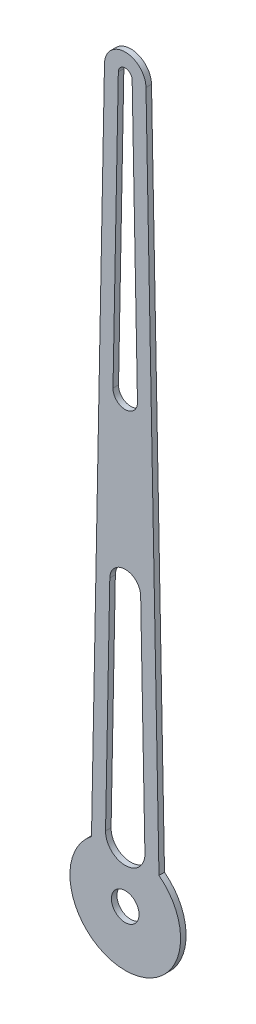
ISO-10303-21;
HEADER;
FILE_DESCRIPTION(('STEP AP214'),'2;1');
FILE_NAME('part.step','',(''),(''),'','','');
FILE_SCHEMA(('AUTOMOTIVE_DESIGN { 1 0 10303 214 1 1 1 1 }'));
ENDSEC;
DATA;
#1=APPLICATION_CONTEXT('core data for automotive mechanical design processes');
#2=APPLICATION_PROTOCOL_DEFINITION('international standard','automotive_design',2000,#1);
#3=PRODUCT_CONTEXT('',#1,'mechanical');
#4=PRODUCT('Part','Part','',(#3));
#5=PRODUCT_RELATED_PRODUCT_CATEGORY('part','',(#4));
#6=PRODUCT_DEFINITION_FORMATION('','',#4);
#7=PRODUCT_DEFINITION_CONTEXT('part definition',#1,'design');
#8=PRODUCT_DEFINITION('design','',#6,#7);
#9=PRODUCT_DEFINITION_SHAPE('','',#8);
#10=(LENGTH_UNIT() NAMED_UNIT(*) SI_UNIT(.MILLI.,.METRE.));
#11=(NAMED_UNIT(*) PLANE_ANGLE_UNIT() SI_UNIT($,.RADIAN.));
#12=(NAMED_UNIT(*) SI_UNIT($,.STERADIAN.) SOLID_ANGLE_UNIT());
#13=UNCERTAINTY_MEASURE_WITH_UNIT(LENGTH_MEASURE(1.E-05),#10,'distance_accuracy_value','');
#14=(GEOMETRIC_REPRESENTATION_CONTEXT(3) GLOBAL_UNCERTAINTY_ASSIGNED_CONTEXT((#13)) GLOBAL_UNIT_ASSIGNED_CONTEXT((#10,
#11,#12)) REPRESENTATION_CONTEXT('',''));
#15=CARTESIAN_POINT('',(0.,0.,0.));
#16=DIRECTION('',(0.,0.,1.));
#17=DIRECTION('',(1.,0.,0.));
#18=AXIS2_PLACEMENT_3D('',#15,#16,#17);
#19=CARTESIAN_POINT('',(0.,0.,0.1));
#20=DIRECTION('',(0.,0.,1.));
#21=DIRECTION('',(1.,0.,0.));
#22=AXIS2_PLACEMENT_3D('',#19,#20,#21);
#23=PLANE('',#22);
#24=CARTESIAN_POINT('',(0.,0.,0.1));
#25=DIRECTION('',(0.,0.,1.));
#26=DIRECTION('',(1.,0.,0.));
#27=AXIS2_PLACEMENT_3D('',#24,#25,#26);
#28=CIRCLE('',#27,0.25);
#29=CARTESIAN_POINT('',(0.25,0.,0.1));
#30=VERTEX_POINT('',#29);
#31=EDGE_CURVE('E167',#30,#30,#28,.T.);
#32=ORIENTED_EDGE('',*,*,#31,.F.);
#33=EDGE_LOOP('',(#32));
#34=FACE_BOUND('',#33,.T.);
#35=CARTESIAN_POINT('',(0.,0.,0.1));
#36=DIRECTION('',(0.,0.,1.));
#37=DIRECTION('',(1.,0.,0.));
#38=AXIS2_PLACEMENT_3D('',#35,#36,#37);
#39=CIRCLE('',#38,1.);
#40=CARTESIAN_POINT('',(-0.609872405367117,0.792499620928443,0.1));
#41=VERTEX_POINT('',#40);
#42=CARTESIAN_POINT('',(0.609872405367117,0.792499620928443,0.1));
#43=VERTEX_POINT('',#42);
#44=EDGE_CURVE('E201',#41,#43,#39,.T.);
#45=ORIENTED_EDGE('',*,*,#44,.T.);
#46=DIRECTION('',(-0.0192307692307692,0.999815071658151,0.));
#47=VECTOR('',#46,1.);
#48=CARTESIAN_POINT('',(0.374930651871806,13.0072115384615,0.1));
#49=LINE('',#48,#47);
#50=CARTESIAN_POINT('',(0.374930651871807,13.0072115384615,0.1));
#51=VERTEX_POINT('',#50);
#52=EDGE_CURVE('E206',#43,#51,#49,.T.);
#53=ORIENTED_EDGE('',*,*,#52,.T.);
#54=CARTESIAN_POINT('',(0.,13.,0.1));
#55=DIRECTION('',(0.,0.,1.));
#56=DIRECTION('',(1.,0.,0.));
#57=AXIS2_PLACEMENT_3D('',#54,#55,#56);
#58=CIRCLE('',#57,0.375);
#59=CARTESIAN_POINT('',(-0.374930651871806,13.0072115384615,0.1));
#60=VERTEX_POINT('',#59);
#61=EDGE_CURVE('E207',#51,#60,#58,.T.);
#62=ORIENTED_EDGE('',*,*,#61,.T.);
#63=DIRECTION('',(-0.0192307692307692,-0.999815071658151,0.));
#64=VECTOR('',#63,1.);
#65=CARTESIAN_POINT('',(-0.374930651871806,13.0072115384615,0.1));
#66=LINE('',#65,#64);
#67=EDGE_CURVE('E211',#60,#41,#66,.T.);
#68=ORIENTED_EDGE('',*,*,#67,.T.);
#69=EDGE_LOOP('',(#45,#53,#62,#68));
#70=FACE_BOUND('',#69,.T.);
#71=DIRECTION('',(-0.0192307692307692,-0.999815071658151,0.));
#72=VECTOR('',#71,1.);
#73=CARTESIAN_POINT('',(-0.124976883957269,13.0024038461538,0.1));
#74=LINE('',#73,#72);
#75=CARTESIAN_POINT('',(-0.124976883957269,13.0024038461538,0.1));
#76=VERTEX_POINT('',#75);
#77=CARTESIAN_POINT('',(-0.221112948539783,8.00425295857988,0.1));
#78=VERTEX_POINT('',#77);
#79=EDGE_CURVE('E173',#76,#78,#74,.T.);
#80=ORIENTED_EDGE('',*,*,#79,.F.);
#81=CARTESIAN_POINT('',(0.,13.,0.1));
#82=DIRECTION('',(0.,0.,1.));
#83=DIRECTION('',(1.,0.,0.));
#84=AXIS2_PLACEMENT_3D('',#81,#82,#83);
#85=CIRCLE('',#84,0.125);
#86=CARTESIAN_POINT('',(0.124976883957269,13.0024038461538,0.1));
#87=VERTEX_POINT('',#86);
#88=EDGE_CURVE('E171',#87,#76,#85,.T.);
#89=ORIENTED_EDGE('',*,*,#88,.F.);
#90=DIRECTION('',(-0.0192307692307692,0.999815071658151,0.));
#91=VECTOR('',#90,1.);
#92=CARTESIAN_POINT('',(0.124976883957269,13.0024038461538,0.1));
#93=LINE('',#92,#91);
#94=CARTESIAN_POINT('',(0.221112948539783,8.00425295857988,0.1));
#95=VERTEX_POINT('',#94);
#96=EDGE_CURVE('E177',#95,#87,#93,.T.);
#97=ORIENTED_EDGE('',*,*,#96,.F.);
#98=CARTESIAN_POINT('',(0.,8.,0.1));
#99=DIRECTION('',(0.,0.,1.));
#100=DIRECTION('',(1.,0.,0.));
#101=AXIS2_PLACEMENT_3D('',#98,#99,#100);
#102=CIRCLE('',#101,0.221153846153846);
#103=EDGE_CURVE('E176',#78,#95,#102,.T.);
#104=ORIENTED_EDGE('',*,*,#103,.F.);
#105=EDGE_LOOP('',(#80,#89,#97,#104));
#106=FACE_BOUND('',#105,.T.);
#107=DIRECTION('',(-0.0192307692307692,-0.999815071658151,0.));
#108=VECTOR('',#107,1.);
#109=CARTESIAN_POINT('',(-0.278794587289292,5.0053624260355,0.1));
#110=LINE('',#109,#108);
#111=CARTESIAN_POINT('',(-0.278794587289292,5.0053624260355,0.1));
#112=VERTEX_POINT('',#111);
#113=CARTESIAN_POINT('',(-0.355703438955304,1.00684171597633,0.1));
#114=VERTEX_POINT('',#113);
#115=EDGE_CURVE('E140',#112,#114,#110,.T.);
#116=ORIENTED_EDGE('',*,*,#115,.F.);
#117=CARTESIAN_POINT('',(0.,5.,0.1));
#118=DIRECTION('',(0.,0.,1.));
#119=DIRECTION('',(1.,0.,0.));
#120=AXIS2_PLACEMENT_3D('',#117,#118,#119);
#121=CIRCLE('',#120,0.278846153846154);
#122=CARTESIAN_POINT('',(0.278794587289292,5.0053624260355,0.1));
#123=VERTEX_POINT('',#122);
#124=EDGE_CURVE('E128',#123,#112,#121,.T.);
#125=ORIENTED_EDGE('',*,*,#124,.F.);
#126=DIRECTION('',(-0.0192307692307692,0.999815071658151,0.));
#127=VECTOR('',#126,1.);
#128=CARTESIAN_POINT('',(0.278794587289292,5.0053624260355,0.1));
#129=LINE('',#128,#127);
#130=CARTESIAN_POINT('',(0.355703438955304,1.00684171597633,0.1));
#131=VERTEX_POINT('',#130);
#132=EDGE_CURVE('E155',#131,#123,#129,.T.);
#133=ORIENTED_EDGE('',*,*,#132,.F.);
#134=CARTESIAN_POINT('',(0.,1.,0.1));
#135=DIRECTION('',(0.,0.,1.));
#136=DIRECTION('',(1.,0.,0.));
#137=AXIS2_PLACEMENT_3D('',#134,#135,#136);
#138=CIRCLE('',#137,0.355769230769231);
#139=EDGE_CURVE('E147',#114,#131,#138,.T.);
#140=ORIENTED_EDGE('',*,*,#139,.F.);
#141=EDGE_LOOP('',(#116,#125,#133,#140));
#142=FACE_BOUND('',#141,.T.);
#143=ADVANCED_FACE('F41',(#34,#70,#106,#142),#23,.T.);
#144=CARTESIAN_POINT('',(0.,0.,0.));
#145=DIRECTION('',(0.,0.,1.));
#146=DIRECTION('',(1.,0.,0.));
#147=AXIS2_PLACEMENT_3D('',#144,#145,#146);
#148=PLANE('',#147);
#149=CARTESIAN_POINT('',(0.,0.,0.));
#150=DIRECTION('',(0.,0.,1.));
#151=DIRECTION('',(1.,0.,0.));
#152=AXIS2_PLACEMENT_3D('',#149,#150,#151);
#153=CIRCLE('',#152,0.25);
#154=CARTESIAN_POINT('',(0.25,0.,0.));
#155=VERTEX_POINT('',#154);
#156=EDGE_CURVE('E148',#155,#155,#153,.T.);
#157=ORIENTED_EDGE('',*,*,#156,.T.);
#158=EDGE_LOOP('',(#157));
#159=FACE_BOUND('',#158,.T.);
#160=CARTESIAN_POINT('',(0.,0.,0.));
#161=DIRECTION('',(0.,0.,1.));
#162=DIRECTION('',(1.,0.,0.));
#163=AXIS2_PLACEMENT_3D('',#160,#161,#162);
#164=CIRCLE('',#163,1.);
#165=CARTESIAN_POINT('',(-0.609872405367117,0.792499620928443,0.));
#166=VERTEX_POINT('',#165);
#167=CARTESIAN_POINT('',(0.609872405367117,0.792499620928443,0.));
#168=VERTEX_POINT('',#167);
#169=EDGE_CURVE('E205',#166,#168,#164,.T.);
#170=ORIENTED_EDGE('',*,*,#169,.F.);
#171=DIRECTION('',(-0.0192307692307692,-0.999815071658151,0.));
#172=VECTOR('',#171,1.);
#173=CARTESIAN_POINT('',(-0.374930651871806,13.0072115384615,0.));
#174=LINE('',#173,#172);
#175=CARTESIAN_POINT('',(-0.374930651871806,13.0072115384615,0.));
#176=VERTEX_POINT('',#175);
#177=EDGE_CURVE('E210',#176,#166,#174,.T.);
#178=ORIENTED_EDGE('',*,*,#177,.F.);
#179=CARTESIAN_POINT('',(0.,13.,0.));
#180=DIRECTION('',(0.,0.,1.));
#181=DIRECTION('',(1.,0.,0.));
#182=AXIS2_PLACEMENT_3D('',#179,#180,#181);
#183=CIRCLE('',#182,0.375);
#184=CARTESIAN_POINT('',(0.374930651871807,13.0072115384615,0.));
#185=VERTEX_POINT('',#184);
#186=EDGE_CURVE('E217',#185,#176,#183,.T.);
#187=ORIENTED_EDGE('',*,*,#186,.F.);
#188=DIRECTION('',(-0.0192307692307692,0.999815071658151,0.));
#189=VECTOR('',#188,1.);
#190=CARTESIAN_POINT('',(0.374930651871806,13.0072115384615,0.));
#191=LINE('',#190,#189);
#192=EDGE_CURVE('E216',#168,#185,#191,.T.);
#193=ORIENTED_EDGE('',*,*,#192,.F.);
#194=EDGE_LOOP('',(#170,#178,#187,#193));
#195=FACE_BOUND('',#194,.T.);
#196=CARTESIAN_POINT('',(0.,13.,0.));
#197=DIRECTION('',(0.,0.,1.));
#198=DIRECTION('',(1.,0.,0.));
#199=AXIS2_PLACEMENT_3D('',#196,#197,#198);
#200=CIRCLE('',#199,0.125);
#201=CARTESIAN_POINT('',(0.124976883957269,13.0024038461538,0.));
#202=VERTEX_POINT('',#201);
#203=CARTESIAN_POINT('',(-0.124976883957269,13.0024038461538,0.));
#204=VERTEX_POINT('',#203);
#205=EDGE_CURVE('E166',#202,#204,#200,.T.);
#206=ORIENTED_EDGE('',*,*,#205,.T.);
#207=DIRECTION('',(-0.0192307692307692,-0.999815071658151,0.));
#208=VECTOR('',#207,1.);
#209=CARTESIAN_POINT('',(-0.124976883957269,13.0024038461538,0.));
#210=LINE('',#209,#208);
#211=CARTESIAN_POINT('',(-0.221112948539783,8.00425295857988,0.));
#212=VERTEX_POINT('',#211);
#213=EDGE_CURVE('E183',#204,#212,#210,.T.);
#214=ORIENTED_EDGE('',*,*,#213,.T.);
#215=CARTESIAN_POINT('',(0.,8.,0.));
#216=DIRECTION('',(0.,0.,1.));
#217=DIRECTION('',(1.,0.,0.));
#218=AXIS2_PLACEMENT_3D('',#215,#216,#217);
#219=CIRCLE('',#218,0.221153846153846);
#220=CARTESIAN_POINT('',(0.221112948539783,8.00425295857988,0.));
#221=VERTEX_POINT('',#220);
#222=EDGE_CURVE('E189',#212,#221,#219,.T.);
#223=ORIENTED_EDGE('',*,*,#222,.T.);
#224=DIRECTION('',(-0.0192307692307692,0.999815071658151,0.));
#225=VECTOR('',#224,1.);
#226=CARTESIAN_POINT('',(0.124976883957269,13.0024038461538,0.));
#227=LINE('',#226,#225);
#228=EDGE_CURVE('E172',#221,#202,#227,.T.);
#229=ORIENTED_EDGE('',*,*,#228,.T.);
#230=EDGE_LOOP('',(#206,#214,#223,#229));
#231=FACE_BOUND('',#230,.T.);
#232=CARTESIAN_POINT('',(0.,5.,0.));
#233=DIRECTION('',(0.,0.,1.));
#234=DIRECTION('',(1.,0.,0.));
#235=AXIS2_PLACEMENT_3D('',#232,#233,#234);
#236=CIRCLE('',#235,0.278846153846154);
#237=CARTESIAN_POINT('',(0.278794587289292,5.0053624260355,0.));
#238=VERTEX_POINT('',#237);
#239=CARTESIAN_POINT('',(-0.278794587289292,5.0053624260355,0.));
#240=VERTEX_POINT('',#239);
#241=EDGE_CURVE('E63',#238,#240,#236,.T.);
#242=ORIENTED_EDGE('',*,*,#241,.T.);
#243=DIRECTION('',(-0.0192307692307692,-0.999815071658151,0.));
#244=VECTOR('',#243,1.);
#245=CARTESIAN_POINT('',(-0.278794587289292,5.0053624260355,0.));
#246=LINE('',#245,#244);
#247=CARTESIAN_POINT('',(-0.355703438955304,1.00684171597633,0.));
#248=VERTEX_POINT('',#247);
#249=EDGE_CURVE('E144',#240,#248,#246,.T.);
#250=ORIENTED_EDGE('',*,*,#249,.T.);
#251=CARTESIAN_POINT('',(0.,1.,0.));
#252=DIRECTION('',(0.,0.,1.));
#253=DIRECTION('',(1.,0.,0.));
#254=AXIS2_PLACEMENT_3D('',#251,#252,#253);
#255=CIRCLE('',#254,0.355769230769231);
#256=CARTESIAN_POINT('',(0.355703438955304,1.00684171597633,0.));
#257=VERTEX_POINT('',#256);
#258=EDGE_CURVE('E158',#248,#257,#255,.T.);
#259=ORIENTED_EDGE('',*,*,#258,.T.);
#260=DIRECTION('',(-0.0192307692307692,0.999815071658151,0.));
#261=VECTOR('',#260,1.);
#262=CARTESIAN_POINT('',(0.278794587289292,5.0053624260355,0.));
#263=LINE('',#262,#261);
#264=EDGE_CURVE('E138',#257,#238,#263,.T.);
#265=ORIENTED_EDGE('',*,*,#264,.T.);
#266=EDGE_LOOP('',(#242,#250,#259,#265));
#267=FACE_BOUND('',#266,.T.);
#268=ADVANCED_FACE('F237',(#159,#195,#231,#267),#148,.F.);
#269=CARTESIAN_POINT('',(0.,0.,0.1));
#270=DIRECTION('',(0.,0.,-1.));
#271=DIRECTION('',(-1.,0.,0.));
#272=AXIS2_PLACEMENT_3D('',#269,#270,#271);
#273=CYLINDRICAL_SURFACE('',#272,1.);
#274=ORIENTED_EDGE('',*,*,#169,.T.);
#275=DIRECTION('',(0.,0.,-1.));
#276=VECTOR('',#275,1.);
#277=CARTESIAN_POINT('',(0.609872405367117,0.792499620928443,0.1));
#278=LINE('',#277,#276);
#279=EDGE_CURVE('E11',#43,#168,#278,.T.);
#280=ORIENTED_EDGE('',*,*,#279,.F.);
#281=ORIENTED_EDGE('',*,*,#44,.F.);
#282=DIRECTION('',(0.,0.,-1.));
#283=VECTOR('',#282,1.);
#284=CARTESIAN_POINT('',(-0.609872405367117,0.792499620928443,0.1));
#285=LINE('',#284,#283);
#286=EDGE_CURVE('E213',#41,#166,#285,.T.);
#287=ORIENTED_EDGE('',*,*,#286,.T.);
#288=EDGE_LOOP('',(#274,#280,#281,#287));
#289=FACE_BOUND('',#288,.T.);
#290=ADVANCED_FACE('F43',(#289),#273,.T.);
#291=CARTESIAN_POINT('',(0.374930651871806,13.0072115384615,0.1));
#292=DIRECTION('',(-0.999815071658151,-0.0192307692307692,0.));
#293=DIRECTION('',(0.0192307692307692,-0.999815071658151,0.));
#294=AXIS2_PLACEMENT_3D('',#291,#292,#293);
#295=PLANE('',#294);
#296=ORIENTED_EDGE('',*,*,#192,.T.);
#297=DIRECTION('',(0.,0.,-1.));
#298=VECTOR('',#297,1.);
#299=CARTESIAN_POINT('',(0.374930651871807,13.0072115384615,0.1));
#300=LINE('',#299,#298);
#301=EDGE_CURVE('E47',#51,#185,#300,.T.);
#302=ORIENTED_EDGE('',*,*,#301,.F.);
#303=ORIENTED_EDGE('',*,*,#52,.F.);
#304=ORIENTED_EDGE('',*,*,#279,.T.);
#305=EDGE_LOOP('',(#296,#302,#303,#304));
#306=FACE_BOUND('',#305,.T.);
#307=ADVANCED_FACE('F246',(#306),#295,.F.);
#308=CARTESIAN_POINT('',(0.,13.,0.1));
#309=DIRECTION('',(0.,0.,-1.));
#310=DIRECTION('',(-1.,0.,0.));
#311=AXIS2_PLACEMENT_3D('',#308,#309,#310);
#312=CYLINDRICAL_SURFACE('',#311,0.375);
#313=ORIENTED_EDGE('',*,*,#186,.T.);
#314=DIRECTION('',(0.,0.,-1.));
#315=VECTOR('',#314,1.);
#316=CARTESIAN_POINT('',(-0.374930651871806,13.0072115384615,0.1));
#317=LINE('',#316,#315);
#318=EDGE_CURVE('E224',#60,#176,#317,.T.);
#319=ORIENTED_EDGE('',*,*,#318,.F.);
#320=ORIENTED_EDGE('',*,*,#61,.F.);
#321=ORIENTED_EDGE('',*,*,#301,.T.);
#322=EDGE_LOOP('',(#313,#319,#320,#321));
#323=FACE_BOUND('',#322,.T.);
#324=ADVANCED_FACE('F227',(#323),#312,.T.);
#325=CARTESIAN_POINT('',(-0.374930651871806,13.0072115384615,0.1));
#326=DIRECTION('',(0.999815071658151,-0.0192307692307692,0.));
#327=DIRECTION('',(0.0192307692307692,0.999815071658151,0.));
#328=AXIS2_PLACEMENT_3D('',#325,#326,#327);
#329=PLANE('',#328);
#330=ORIENTED_EDGE('',*,*,#177,.T.);
#331=ORIENTED_EDGE('',*,*,#286,.F.);
#332=ORIENTED_EDGE('',*,*,#67,.F.);
#333=ORIENTED_EDGE('',*,*,#318,.T.);
#334=EDGE_LOOP('',(#330,#331,#332,#333));
#335=FACE_BOUND('',#334,.T.);
#336=ADVANCED_FACE('F238',(#335),#329,.F.);
#337=CARTESIAN_POINT('',(0.,13.,0.1));
#338=DIRECTION('',(0.,0.,-1.));
#339=DIRECTION('',(-1.,0.,0.));
#340=AXIS2_PLACEMENT_3D('',#337,#338,#339);
#341=CYLINDRICAL_SURFACE('',#340,0.125);
#342=ORIENTED_EDGE('',*,*,#205,.F.);
#343=DIRECTION('',(0.,0.,-1.));
#344=VECTOR('',#343,1.);
#345=CARTESIAN_POINT('',(0.124976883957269,13.0024038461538,0.1));
#346=LINE('',#345,#344);
#347=EDGE_CURVE('E185',#87,#202,#346,.T.);
#348=ORIENTED_EDGE('',*,*,#347,.F.);
#349=ORIENTED_EDGE('',*,*,#88,.T.);
#350=DIRECTION('',(0.,0.,-1.));
#351=VECTOR('',#350,1.);
#352=CARTESIAN_POINT('',(-0.124976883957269,13.0024038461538,0.1));
#353=LINE('',#352,#351);
#354=EDGE_CURVE('E200',#76,#204,#353,.T.);
#355=ORIENTED_EDGE('',*,*,#354,.T.);
#356=EDGE_LOOP('',(#342,#348,#349,#355));
#357=FACE_BOUND('',#356,.T.);
#358=ADVANCED_FACE('F262',(#357),#341,.F.);
#359=CARTESIAN_POINT('',(-0.124976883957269,13.0024038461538,0.1));
#360=DIRECTION('',(0.999815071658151,-0.0192307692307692,0.));
#361=DIRECTION('',(0.0192307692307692,0.999815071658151,0.));
#362=AXIS2_PLACEMENT_3D('',#359,#360,#361);
#363=PLANE('',#362);
#364=ORIENTED_EDGE('',*,*,#213,.F.);
#365=ORIENTED_EDGE('',*,*,#354,.F.);
#366=ORIENTED_EDGE('',*,*,#79,.T.);
#367=DIRECTION('',(0.,0.,-1.));
#368=VECTOR('',#367,1.);
#369=CARTESIAN_POINT('',(-0.221112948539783,8.00425295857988,0.1));
#370=LINE('',#369,#368);
#371=EDGE_CURVE('E197',#78,#212,#370,.T.);
#372=ORIENTED_EDGE('',*,*,#371,.T.);
#373=EDGE_LOOP('',(#364,#365,#366,#372));
#374=FACE_BOUND('',#373,.T.);
#375=ADVANCED_FACE('F271',(#374),#363,.T.);
#376=CARTESIAN_POINT('',(0.,8.,0.1));
#377=DIRECTION('',(0.,0.,-1.));
#378=DIRECTION('',(-1.,0.,0.));
#379=AXIS2_PLACEMENT_3D('',#376,#377,#378);
#380=CYLINDRICAL_SURFACE('',#379,0.221153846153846);
#381=ORIENTED_EDGE('',*,*,#222,.F.);
#382=ORIENTED_EDGE('',*,*,#371,.F.);
#383=ORIENTED_EDGE('',*,*,#103,.T.);
#384=DIRECTION('',(0.,0.,-1.));
#385=VECTOR('',#384,1.);
#386=CARTESIAN_POINT('',(0.221112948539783,8.00425295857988,0.1));
#387=LINE('',#386,#385);
#388=EDGE_CURVE('E192',#95,#221,#387,.T.);
#389=ORIENTED_EDGE('',*,*,#388,.T.);
#390=EDGE_LOOP('',(#381,#382,#383,#389));
#391=FACE_BOUND('',#390,.T.);
#392=ADVANCED_FACE('F277',(#391),#380,.F.);
#393=CARTESIAN_POINT('',(0.124976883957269,13.0024038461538,0.1));
#394=DIRECTION('',(-0.999815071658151,-0.0192307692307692,0.));
#395=DIRECTION('',(0.0192307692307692,-0.999815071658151,0.));
#396=AXIS2_PLACEMENT_3D('',#393,#394,#395);
#397=PLANE('',#396);
#398=ORIENTED_EDGE('',*,*,#228,.F.);
#399=ORIENTED_EDGE('',*,*,#388,.F.);
#400=ORIENTED_EDGE('',*,*,#96,.T.);
#401=ORIENTED_EDGE('',*,*,#347,.T.);
#402=EDGE_LOOP('',(#398,#399,#400,#401));
#403=FACE_BOUND('',#402,.T.);
#404=ADVANCED_FACE('F285',(#403),#397,.T.);
#405=CARTESIAN_POINT('',(0.,0.,0.1));
#406=DIRECTION('',(0.,0.,-1.));
#407=DIRECTION('',(-1.,0.,0.));
#408=AXIS2_PLACEMENT_3D('',#405,#406,#407);
#409=CYLINDRICAL_SURFACE('',#408,0.25);
#410=ORIENTED_EDGE('',*,*,#31,.T.);
#411=EDGE_LOOP('',(#410));
#412=FACE_BOUND('',#411,.T.);
#413=ORIENTED_EDGE('',*,*,#156,.F.);
#414=EDGE_LOOP('',(#413));
#415=FACE_BOUND('',#414,.T.);
#416=ADVANCED_FACE('F297',(#412,#415),#409,.F.);
#417=CARTESIAN_POINT('',(0.,5.,0.1));
#418=DIRECTION('',(0.,0.,-1.));
#419=DIRECTION('',(-1.,0.,0.));
#420=AXIS2_PLACEMENT_3D('',#417,#418,#419);
#421=CYLINDRICAL_SURFACE('',#420,0.278846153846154);
#422=ORIENTED_EDGE('',*,*,#241,.F.);
#423=DIRECTION('',(0.,0.,-1.));
#424=VECTOR('',#423,1.);
#425=CARTESIAN_POINT('',(0.278794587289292,5.0053624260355,0.1));
#426=LINE('',#425,#424);
#427=EDGE_CURVE('E131',#123,#238,#426,.T.);
#428=ORIENTED_EDGE('',*,*,#427,.F.);
#429=ORIENTED_EDGE('',*,*,#124,.T.);
#430=DIRECTION('',(0.,0.,-1.));
#431=VECTOR('',#430,1.);
#432=CARTESIAN_POINT('',(-0.278794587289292,5.0053624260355,0.1));
#433=LINE('',#432,#431);
#434=EDGE_CURVE('E134',#112,#240,#433,.T.);
#435=ORIENTED_EDGE('',*,*,#434,.T.);
#436=EDGE_LOOP('',(#422,#428,#429,#435));
#437=FACE_BOUND('',#436,.T.);
#438=ADVANCED_FACE('F135',(#437),#421,.F.);
#439=CARTESIAN_POINT('',(-0.278794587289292,5.0053624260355,0.1));
#440=DIRECTION('',(0.999815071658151,-0.0192307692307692,0.));
#441=DIRECTION('',(0.0192307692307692,0.999815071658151,0.));
#442=AXIS2_PLACEMENT_3D('',#439,#440,#441);
#443=PLANE('',#442);
#444=ORIENTED_EDGE('',*,*,#249,.F.);
#445=ORIENTED_EDGE('',*,*,#434,.F.);
#446=ORIENTED_EDGE('',*,*,#115,.T.);
#447=DIRECTION('',(0.,0.,-1.));
#448=VECTOR('',#447,1.);
#449=CARTESIAN_POINT('',(-0.355703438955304,1.00684171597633,0.1));
#450=LINE('',#449,#448);
#451=EDGE_CURVE('E150',#114,#248,#450,.T.);
#452=ORIENTED_EDGE('',*,*,#451,.T.);
#453=EDGE_LOOP('',(#444,#445,#446,#452));
#454=FACE_BOUND('',#453,.T.);
#455=ADVANCED_FACE('F142',(#454),#443,.T.);
#456=CARTESIAN_POINT('',(0.,1.,0.1));
#457=DIRECTION('',(0.,0.,-1.));
#458=DIRECTION('',(-1.,0.,0.));
#459=AXIS2_PLACEMENT_3D('',#456,#457,#458);
#460=CYLINDRICAL_SURFACE('',#459,0.355769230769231);
#461=ORIENTED_EDGE('',*,*,#258,.F.);
#462=ORIENTED_EDGE('',*,*,#451,.F.);
#463=ORIENTED_EDGE('',*,*,#139,.T.);
#464=DIRECTION('',(0.,0.,-1.));
#465=VECTOR('',#464,1.);
#466=CARTESIAN_POINT('',(0.355703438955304,1.00684171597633,0.1));
#467=LINE('',#466,#465);
#468=EDGE_CURVE('E57',#131,#257,#467,.T.);
#469=ORIENTED_EDGE('',*,*,#468,.T.);
#470=EDGE_LOOP('',(#461,#462,#463,#469));
#471=FACE_BOUND('',#470,.T.);
#472=ADVANCED_FACE('F308',(#471),#460,.F.);
#473=CARTESIAN_POINT('',(0.278794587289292,5.0053624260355,0.1));
#474=DIRECTION('',(-0.999815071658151,-0.0192307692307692,0.));
#475=DIRECTION('',(0.0192307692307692,-0.999815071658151,0.));
#476=AXIS2_PLACEMENT_3D('',#473,#474,#475);
#477=PLANE('',#476);
#478=ORIENTED_EDGE('',*,*,#264,.F.);
#479=ORIENTED_EDGE('',*,*,#468,.F.);
#480=ORIENTED_EDGE('',*,*,#132,.T.);
#481=ORIENTED_EDGE('',*,*,#427,.T.);
#482=EDGE_LOOP('',(#478,#479,#480,#481));
#483=FACE_BOUND('',#482,.T.);
#484=ADVANCED_FACE('F310',(#483),#477,.T.);
#485=CLOSED_SHELL('',(#143,#268,#290,#307,#324,#336,#358,#375,#392,#404,#416,#438,#455,#472,#484));
#486=MANIFOLD_SOLID_BREP('B2',#485);
#487=ADVANCED_BREP_SHAPE_REPRESENTATION('',(#18,#486),#14);
#488=SHAPE_DEFINITION_REPRESENTATION(#9,#487);
ENDSEC;
END-ISO-10303-21;
